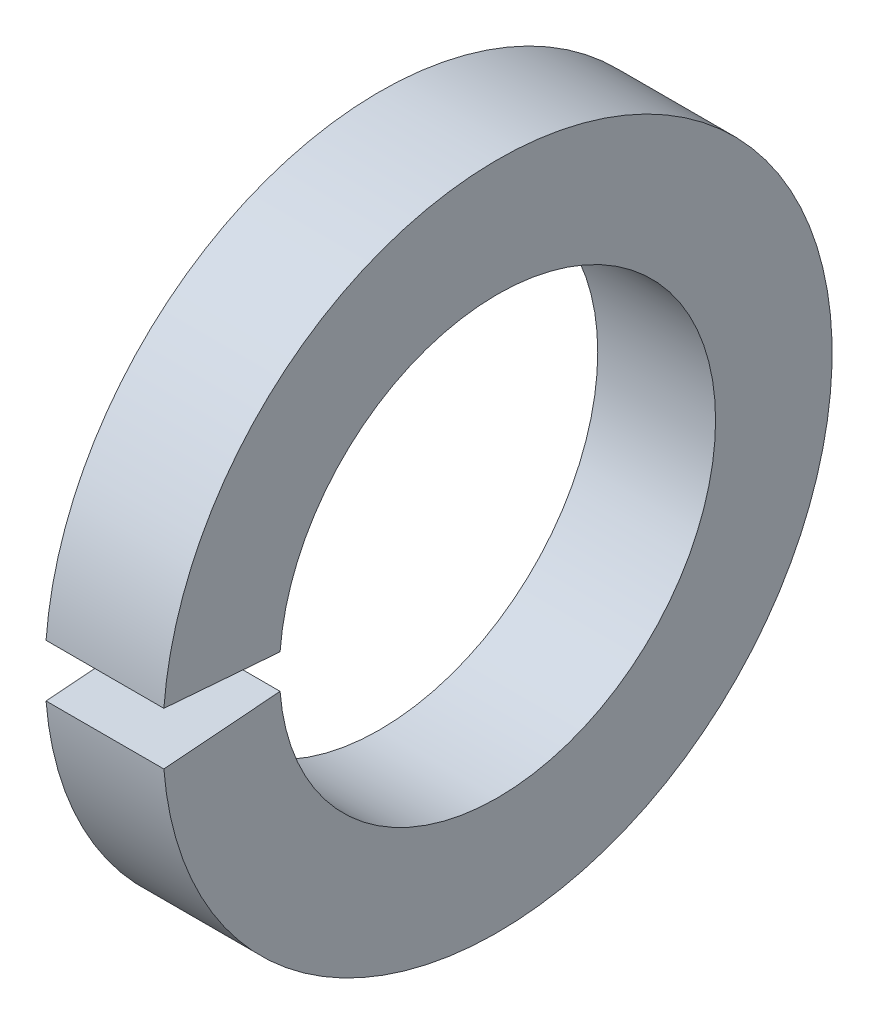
from build123d import *

# Parameters (mm, degrees)
SKETCH1_W = 1.1938
SKETCH1_H = 1.1811
GAP_DEPTH = 5.94181789


with BuildPart() as part:
    # Sketch1 → Base-Revolve (revolve)
    with BuildSketch(Plane.XY, mode=Mode.PRIVATE) as base_revolve_sk:
        with Locations((-0.5969, 2.80035)):
            Rectangle(SKETCH1_W, SKETCH1_H)
    revolve(base_revolve_sk.sketch.rotate(Axis((-34.925, 0, 0), (1, 0, 0)), 90), axis=Axis((-34.925, 0, 0), (1, 0, 0)))

    # Sketch2 → Gap (cut, through all)
    with BuildSketch(Plane(origin=(0, 0, 0), x_dir=(0, -1, 0), z_dir=(-1, 0, 0))):
        with BuildLine():
            Line((0, 0), (0.271367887, 3.448055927))
            ThreePointArc((0.271367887, 3.448055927), (0, 3.458718), (-0.271367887, 3.448055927))
            Line((-0.271367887, 3.448055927), (0, 0))
        make_face()
    extrude(amount=GAP_DEPTH, mode=Mode.SUBTRACT)


solid = part.part
